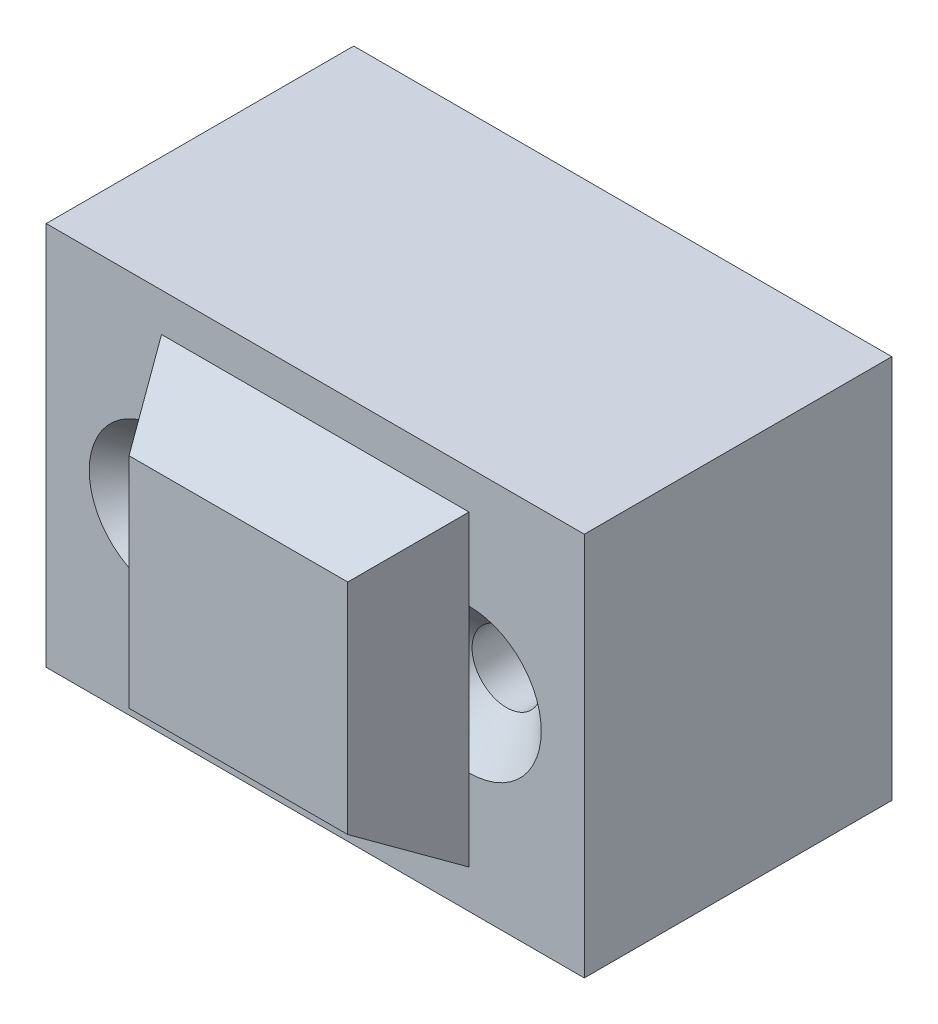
from build123d import *

# Parameters (mm, degrees)
ESQUISSE1_W                                    = 35
ESQUISSE1_H                                    = 25
EXTRUSION1_DEPTH                               = 20
FRAISAGE_POUR_VIS_T_TE_FRAIS_E_M41_D           = 4.5
FRAISAGE_POUR_VIS_T_TE_FRAIS_E_M41_CSINK_D     = 9.4
FRAISAGE_POUR_VIS_T_TE_FRAIS_E_M41_CSINK_ANGLE = 90
ESQUISSE4_W                                    = 20
ESQUISSE4_H                                    = 20
EXTRUSION2_DEPTH                               = 5
EXTRUSION2_TAPER                               = 30


with BuildPart() as part:
    # Esquisse1 → Extrusion1 (new body)
    with BuildSketch(Plane.XY):
        with Locations((17.5, 12.5)):
            Rectangle(ESQUISSE1_W, ESQUISSE1_H)
    extrude(amount=EXTRUSION1_DEPTH)

    # Fraisage pour vis _ t_te frais_e M41 (through all)
    with Locations(Plane.XY.offset(20)):
        with Locations((7.5, 12.5), (27.5, 12.5)):
            CounterSinkHole(FRAISAGE_POUR_VIS_T_TE_FRAIS_E_M41_D / 2, FRAISAGE_POUR_VIS_T_TE_FRAIS_E_M41_CSINK_D / 2, counter_sink_angle=FRAISAGE_POUR_VIS_T_TE_FRAIS_E_M41_CSINK_ANGLE)

    # Esquisse4 → Extrusion2 (add)
    with BuildSketch(Plane.XY.offset(20)):
        with Locations((17.5, 12.5)):
            Rectangle(ESQUISSE4_W, ESQUISSE4_H)
    extrude(amount=EXTRUSION2_DEPTH, taper=EXTRUSION2_TAPER)


solid = part.part
